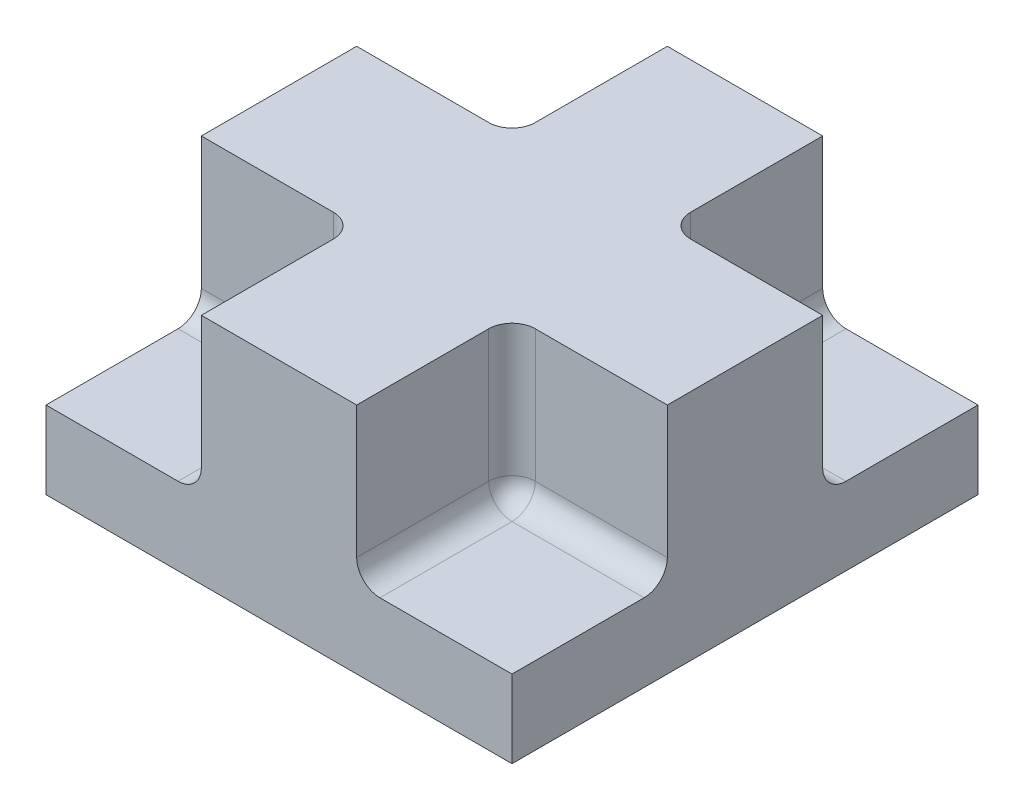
ISO-10303-21;
HEADER;
FILE_DESCRIPTION(('STEP AP214'),'2;1');
FILE_NAME('part.step','',(''),(''),'','','');
FILE_SCHEMA(('AUTOMOTIVE_DESIGN { 1 0 10303 214 1 1 1 1 }'));
ENDSEC;
DATA;
#1=APPLICATION_CONTEXT('core data for automotive mechanical design processes');
#2=APPLICATION_PROTOCOL_DEFINITION('international standard','automotive_design',2000,#1);
#3=PRODUCT_CONTEXT('',#1,'mechanical');
#4=PRODUCT('Part','Part','',(#3));
#5=PRODUCT_RELATED_PRODUCT_CATEGORY('part','',(#4));
#6=PRODUCT_DEFINITION_FORMATION('','',#4);
#7=PRODUCT_DEFINITION_CONTEXT('part definition',#1,'design');
#8=PRODUCT_DEFINITION('design','',#6,#7);
#9=PRODUCT_DEFINITION_SHAPE('','',#8);
#10=(LENGTH_UNIT() NAMED_UNIT(*) SI_UNIT(.MILLI.,.METRE.));
#11=(NAMED_UNIT(*) PLANE_ANGLE_UNIT() SI_UNIT($,.RADIAN.));
#12=(NAMED_UNIT(*) SI_UNIT($,.STERADIAN.) SOLID_ANGLE_UNIT());
#13=UNCERTAINTY_MEASURE_WITH_UNIT(LENGTH_MEASURE(1.E-05),#10,'distance_accuracy_value','');
#14=(GEOMETRIC_REPRESENTATION_CONTEXT(3) GLOBAL_UNCERTAINTY_ASSIGNED_CONTEXT((#13)) GLOBAL_UNIT_ASSIGNED_CONTEXT((#10,
#11,#12)) REPRESENTATION_CONTEXT('',''));
#15=CARTESIAN_POINT('',(0.,0.,0.));
#16=DIRECTION('',(0.,0.,1.));
#17=DIRECTION('',(1.,0.,0.));
#18=AXIS2_PLACEMENT_3D('',#15,#16,#17);
#19=CARTESIAN_POINT('',(0.,30.,0.));
#20=DIRECTION('',(1.,0.,0.));
#21=DIRECTION('',(0.,0.,-1.));
#22=AXIS2_PLACEMENT_3D('',#19,#20,#21);
#23=PLANE('',#22);
#24=DIRECTION('',(0.,0.,1.));
#25=VECTOR('',#24,1.);
#26=CARTESIAN_POINT('',(0.,30.,0.));
#27=LINE('',#26,#25);
#28=CARTESIAN_POINT('',(0.,30.,-40.));
#29=VERTEX_POINT('',#28);
#30=CARTESIAN_POINT('',(0.,30.,-20.));
#31=VERTEX_POINT('',#30);
#32=EDGE_CURVE('E230',#29,#31,#27,.T.);
#33=ORIENTED_EDGE('',*,*,#32,.F.);
#34=DIRECTION('',(0.,1.,0.));
#35=VECTOR('',#34,1.);
#36=CARTESIAN_POINT('',(0.,10.,-40.));
#37=LINE('',#36,#35);
#38=CARTESIAN_POINT('',(0.,13.,-40.));
#39=VERTEX_POINT('',#38);
#40=EDGE_CURVE('E396',#39,#29,#37,.T.);
#41=ORIENTED_EDGE('',*,*,#40,.F.);
#42=CARTESIAN_POINT('',(0.,13.,-43.));
#43=DIRECTION('',(1.,0.,0.));
#44=DIRECTION('',(0.,0.,-1.));
#45=AXIS2_PLACEMENT_3D('',#42,#43,#44);
#46=CIRCLE('',#45,3.);
#47=CARTESIAN_POINT('',(0.,10.,-43.));
#48=VERTEX_POINT('',#47);
#49=EDGE_CURVE('E308',#39,#48,#46,.T.);
#50=ORIENTED_EDGE('',*,*,#49,.T.);
#51=DIRECTION('',(0.,0.,1.));
#52=VECTOR('',#51,1.);
#53=CARTESIAN_POINT('',(0.,10.,-60.));
#54=LINE('',#53,#52);
#55=CARTESIAN_POINT('',(0.,10.,-60.));
#56=VERTEX_POINT('',#55);
#57=EDGE_CURVE('E391',#56,#48,#54,.T.);
#58=ORIENTED_EDGE('',*,*,#57,.F.);
#59=DIRECTION('',(0.,-1.,0.));
#60=VECTOR('',#59,1.);
#61=CARTESIAN_POINT('',(0.,30.,-60.));
#62=LINE('',#61,#60);
#63=CARTESIAN_POINT('',(0.,0.,-60.));
#64=VERTEX_POINT('',#63);
#65=EDGE_CURVE('E242',#56,#64,#62,.T.);
#66=ORIENTED_EDGE('',*,*,#65,.T.);
#67=DIRECTION('',(0.,0.,1.));
#68=VECTOR('',#67,1.);
#69=CARTESIAN_POINT('',(0.,0.,0.));
#70=LINE('',#69,#68);
#71=CARTESIAN_POINT('',(0.,0.,0.));
#72=VERTEX_POINT('',#71);
#73=EDGE_CURVE('E412',#64,#72,#70,.T.);
#74=ORIENTED_EDGE('',*,*,#73,.T.);
#75=DIRECTION('',(0.,-1.,0.));
#76=VECTOR('',#75,1.);
#77=CARTESIAN_POINT('',(0.,30.,0.));
#78=LINE('',#77,#76);
#79=CARTESIAN_POINT('',(0.,10.,0.));
#80=VERTEX_POINT('',#79);
#81=EDGE_CURVE('E248',#80,#72,#78,.T.);
#82=ORIENTED_EDGE('',*,*,#81,.F.);
#83=DIRECTION('',(0.,0.,1.));
#84=VECTOR('',#83,1.);
#85=CARTESIAN_POINT('',(0.,10.,0.));
#86=LINE('',#85,#84);
#87=CARTESIAN_POINT('',(0.,10.,-17.));
#88=VERTEX_POINT('',#87);
#89=EDGE_CURVE('E404',#88,#80,#86,.T.);
#90=ORIENTED_EDGE('',*,*,#89,.F.);
#91=CARTESIAN_POINT('',(0.,13.,-17.));
#92=DIRECTION('',(1.,0.,0.));
#93=DIRECTION('',(0.,0.,-1.));
#94=AXIS2_PLACEMENT_3D('',#91,#92,#93);
#95=CIRCLE('',#94,3.);
#96=CARTESIAN_POINT('',(0.,13.,-20.));
#97=VERTEX_POINT('',#96);
#98=EDGE_CURVE('E300',#88,#97,#95,.T.);
#99=ORIENTED_EDGE('',*,*,#98,.T.);
#100=DIRECTION('',(0.,1.,0.));
#101=VECTOR('',#100,1.);
#102=CARTESIAN_POINT('',(0.,10.,-20.));
#103=LINE('',#102,#101);
#104=EDGE_CURVE('E410',#97,#31,#103,.T.);
#105=ORIENTED_EDGE('',*,*,#104,.T.);
#106=EDGE_LOOP('',(#33,#41,#50,#58,#66,#74,#82,#90,#99,#105));
#107=FACE_BOUND('',#106,.T.);
#108=ADVANCED_FACE('F33',(#107),#23,.F.);
#109=CARTESIAN_POINT('',(0.,30.,0.));
#110=DIRECTION('',(0.,0.,-1.));
#111=DIRECTION('',(-1.,0.,0.));
#112=AXIS2_PLACEMENT_3D('',#109,#110,#111);
#113=PLANE('',#112);
#114=DIRECTION('',(1.,0.,0.));
#115=VECTOR('',#114,1.);
#116=CARTESIAN_POINT('',(60.,10.,0.));
#117=LINE('',#116,#115);
#118=CARTESIAN_POINT('',(43.,10.,0.));
#119=VERTEX_POINT('',#118);
#120=CARTESIAN_POINT('',(60.,10.,0.));
#121=VERTEX_POINT('',#120);
#122=EDGE_CURVE('E368',#119,#121,#117,.T.);
#123=ORIENTED_EDGE('',*,*,#122,.F.);
#124=CARTESIAN_POINT('',(43.,13.,0.));
#125=DIRECTION('',(0.,0.,-1.));
#126=DIRECTION('',(-1.,0.,0.));
#127=AXIS2_PLACEMENT_3D('',#124,#125,#126);
#128=CIRCLE('',#127,3.);
#129=CARTESIAN_POINT('',(40.,13.,0.));
#130=VERTEX_POINT('',#129);
#131=EDGE_CURVE('E40',#119,#130,#128,.T.);
#132=ORIENTED_EDGE('',*,*,#131,.T.);
#133=DIRECTION('',(0.,1.,0.));
#134=VECTOR('',#133,1.);
#135=CARTESIAN_POINT('',(40.,10.,0.));
#136=LINE('',#135,#134);
#137=CARTESIAN_POINT('',(40.,30.,0.));
#138=VERTEX_POINT('',#137);
#139=EDGE_CURVE('E203',#130,#138,#136,.T.);
#140=ORIENTED_EDGE('',*,*,#139,.T.);
#141=DIRECTION('',(1.,0.,0.));
#142=VECTOR('',#141,1.);
#143=CARTESIAN_POINT('',(0.,30.,0.));
#144=LINE('',#143,#142);
#145=CARTESIAN_POINT('',(20.,30.,0.));
#146=VERTEX_POINT('',#145);
#147=EDGE_CURVE('E208',#146,#138,#144,.T.);
#148=ORIENTED_EDGE('',*,*,#147,.F.);
#149=DIRECTION('',(0.,1.,0.));
#150=VECTOR('',#149,1.);
#151=CARTESIAN_POINT('',(20.,10.,0.));
#152=LINE('',#151,#150);
#153=CARTESIAN_POINT('',(20.,13.,0.));
#154=VERTEX_POINT('',#153);
#155=EDGE_CURVE('E409',#154,#146,#152,.T.);
#156=ORIENTED_EDGE('',*,*,#155,.F.);
#157=CARTESIAN_POINT('',(17.,13.,0.));
#158=DIRECTION('',(0.,0.,-1.));
#159=DIRECTION('',(-1.,0.,0.));
#160=AXIS2_PLACEMENT_3D('',#157,#158,#159);
#161=CIRCLE('',#160,3.);
#162=CARTESIAN_POINT('',(17.,10.,0.));
#163=VERTEX_POINT('',#162);
#164=EDGE_CURVE('E302',#154,#163,#161,.T.);
#165=ORIENTED_EDGE('',*,*,#164,.T.);
#166=DIRECTION('',(1.,0.,0.));
#167=VECTOR('',#166,1.);
#168=CARTESIAN_POINT('',(0.,10.,0.));
#169=LINE('',#168,#167);
#170=EDGE_CURVE('E406',#80,#163,#169,.T.);
#171=ORIENTED_EDGE('',*,*,#170,.F.);
#172=ORIENTED_EDGE('',*,*,#81,.T.);
#173=DIRECTION('',(1.,0.,0.));
#174=VECTOR('',#173,1.);
#175=CARTESIAN_POINT('',(0.,0.,0.));
#176=LINE('',#175,#174);
#177=CARTESIAN_POINT('',(60.,0.,0.));
#178=VERTEX_POINT('',#177);
#179=EDGE_CURVE('E416',#72,#178,#176,.T.);
#180=ORIENTED_EDGE('',*,*,#179,.T.);
#181=DIRECTION('',(0.,-1.,0.));
#182=VECTOR('',#181,1.);
#183=CARTESIAN_POINT('',(60.,30.,0.));
#184=LINE('',#183,#182);
#185=EDGE_CURVE('E246',#121,#178,#184,.T.);
#186=ORIENTED_EDGE('',*,*,#185,.F.);
#187=EDGE_LOOP('',(#123,#132,#140,#148,#156,#165,#171,#172,#180,#186));
#188=FACE_BOUND('',#187,.T.);
#189=ADVANCED_FACE('F205',(#188),#113,.F.);
#190=CARTESIAN_POINT('',(60.,30.,0.));
#191=DIRECTION('',(-1.,0.,0.));
#192=DIRECTION('',(0.,0.,1.));
#193=AXIS2_PLACEMENT_3D('',#190,#191,#192);
#194=PLANE('',#193);
#195=DIRECTION('',(0.,0.,-1.));
#196=VECTOR('',#195,1.);
#197=CARTESIAN_POINT('',(60.,30.,0.));
#198=LINE('',#197,#196);
#199=CARTESIAN_POINT('',(60.,30.,-20.));
#200=VERTEX_POINT('',#199);
#201=CARTESIAN_POINT('',(60.,30.,-40.));
#202=VERTEX_POINT('',#201);
#203=EDGE_CURVE('E229',#200,#202,#198,.T.);
#204=ORIENTED_EDGE('',*,*,#203,.F.);
#205=DIRECTION('',(0.,1.,0.));
#206=VECTOR('',#205,1.);
#207=CARTESIAN_POINT('',(60.,10.,-20.));
#208=LINE('',#207,#206);
#209=CARTESIAN_POINT('',(60.,13.,-20.));
#210=VERTEX_POINT('',#209);
#211=EDGE_CURVE('E213',#210,#200,#208,.T.);
#212=ORIENTED_EDGE('',*,*,#211,.F.);
#213=CARTESIAN_POINT('',(60.,13.,-17.));
#214=DIRECTION('',(-1.,0.,0.));
#215=DIRECTION('',(0.,0.,1.));
#216=AXIS2_PLACEMENT_3D('',#213,#214,#215);
#217=CIRCLE('',#216,3.);
#218=CARTESIAN_POINT('',(60.,10.,-17.));
#219=VERTEX_POINT('',#218);
#220=EDGE_CURVE('E11',#210,#219,#217,.T.);
#221=ORIENTED_EDGE('',*,*,#220,.T.);
#222=DIRECTION('',(0.,0.,-1.));
#223=VECTOR('',#222,1.);
#224=CARTESIAN_POINT('',(60.,10.,0.));
#225=LINE('',#224,#223);
#226=EDGE_CURVE('E222',#121,#219,#225,.T.);
#227=ORIENTED_EDGE('',*,*,#226,.F.);
#228=ORIENTED_EDGE('',*,*,#185,.T.);
#229=DIRECTION('',(0.,0.,-1.));
#230=VECTOR('',#229,1.);
#231=CARTESIAN_POINT('',(60.,0.,0.));
#232=LINE('',#231,#230);
#233=CARTESIAN_POINT('',(60.,0.,-60.));
#234=VERTEX_POINT('',#233);
#235=EDGE_CURVE('E419',#178,#234,#232,.T.);
#236=ORIENTED_EDGE('',*,*,#235,.T.);
#237=DIRECTION('',(0.,-1.,0.));
#238=VECTOR('',#237,1.);
#239=CARTESIAN_POINT('',(60.,30.,-60.));
#240=LINE('',#239,#238);
#241=CARTESIAN_POINT('',(60.,10.,-60.));
#242=VERTEX_POINT('',#241);
#243=EDGE_CURVE('E244',#242,#234,#240,.T.);
#244=ORIENTED_EDGE('',*,*,#243,.F.);
#245=DIRECTION('',(0.,0.,-1.));
#246=VECTOR('',#245,1.);
#247=CARTESIAN_POINT('',(60.,10.,-60.));
#248=LINE('',#247,#246);
#249=CARTESIAN_POINT('',(60.,10.,-43.));
#250=VERTEX_POINT('',#249);
#251=EDGE_CURVE('E376',#250,#242,#248,.T.);
#252=ORIENTED_EDGE('',*,*,#251,.F.);
#253=CARTESIAN_POINT('',(60.,13.,-43.));
#254=DIRECTION('',(-1.,0.,0.));
#255=DIRECTION('',(0.,0.,1.));
#256=AXIS2_PLACEMENT_3D('',#253,#254,#255);
#257=CIRCLE('',#256,3.);
#258=CARTESIAN_POINT('',(60.,13.,-40.));
#259=VERTEX_POINT('',#258);
#260=EDGE_CURVE('E312',#250,#259,#257,.T.);
#261=ORIENTED_EDGE('',*,*,#260,.T.);
#262=DIRECTION('',(0.,1.,0.));
#263=VECTOR('',#262,1.);
#264=CARTESIAN_POINT('',(60.,10.,-40.));
#265=LINE('',#264,#263);
#266=EDGE_CURVE('E382',#259,#202,#265,.T.);
#267=ORIENTED_EDGE('',*,*,#266,.T.);
#268=EDGE_LOOP('',(#204,#212,#221,#227,#228,#236,#244,#252,#261,#267));
#269=FACE_BOUND('',#268,.T.);
#270=ADVANCED_FACE('F484',(#269),#194,.F.);
#271=CARTESIAN_POINT('',(0.,30.,-60.));
#272=DIRECTION('',(0.,0.,1.));
#273=DIRECTION('',(1.,0.,0.));
#274=AXIS2_PLACEMENT_3D('',#271,#272,#273);
#275=PLANE('',#274);
#276=DIRECTION('',(-1.,0.,0.));
#277=VECTOR('',#276,1.);
#278=CARTESIAN_POINT('',(0.,30.,-60.));
#279=LINE('',#278,#277);
#280=CARTESIAN_POINT('',(40.,30.,-60.));
#281=VERTEX_POINT('',#280);
#282=CARTESIAN_POINT('',(20.,30.,-60.));
#283=VERTEX_POINT('',#282);
#284=EDGE_CURVE('E233',#281,#283,#279,.T.);
#285=ORIENTED_EDGE('',*,*,#284,.F.);
#286=DIRECTION('',(0.,1.,0.));
#287=VECTOR('',#286,1.);
#288=CARTESIAN_POINT('',(40.,10.,-60.));
#289=LINE('',#288,#287);
#290=CARTESIAN_POINT('',(40.,13.,-60.));
#291=VERTEX_POINT('',#290);
#292=EDGE_CURVE('E381',#291,#281,#289,.T.);
#293=ORIENTED_EDGE('',*,*,#292,.F.);
#294=CARTESIAN_POINT('',(43.,13.,-60.));
#295=DIRECTION('',(0.,0.,1.));
#296=DIRECTION('',(1.,0.,0.));
#297=AXIS2_PLACEMENT_3D('',#294,#295,#296);
#298=CIRCLE('',#297,3.);
#299=CARTESIAN_POINT('',(43.,10.,-60.));
#300=VERTEX_POINT('',#299);
#301=EDGE_CURVE('E314',#291,#300,#298,.T.);
#302=ORIENTED_EDGE('',*,*,#301,.T.);
#303=DIRECTION('',(-1.,0.,0.));
#304=VECTOR('',#303,1.);
#305=CARTESIAN_POINT('',(60.,10.,-60.));
#306=LINE('',#305,#304);
#307=EDGE_CURVE('E378',#242,#300,#306,.T.);
#308=ORIENTED_EDGE('',*,*,#307,.F.);
#309=ORIENTED_EDGE('',*,*,#243,.T.);
#310=DIRECTION('',(-1.,0.,0.));
#311=VECTOR('',#310,1.);
#312=CARTESIAN_POINT('',(0.,0.,-60.));
#313=LINE('',#312,#311);
#314=EDGE_CURVE('E236',#234,#64,#313,.T.);
#315=ORIENTED_EDGE('',*,*,#314,.T.);
#316=ORIENTED_EDGE('',*,*,#65,.F.);
#317=DIRECTION('',(-1.,0.,0.));
#318=VECTOR('',#317,1.);
#319=CARTESIAN_POINT('',(0.,10.,-60.));
#320=LINE('',#319,#318);
#321=CARTESIAN_POINT('',(17.,10.,-60.));
#322=VERTEX_POINT('',#321);
#323=EDGE_CURVE('E394',#322,#56,#320,.T.);
#324=ORIENTED_EDGE('',*,*,#323,.F.);
#325=CARTESIAN_POINT('',(17.,13.,-60.));
#326=DIRECTION('',(0.,0.,1.));
#327=DIRECTION('',(1.,0.,0.));
#328=AXIS2_PLACEMENT_3D('',#325,#326,#327);
#329=CIRCLE('',#328,3.);
#330=CARTESIAN_POINT('',(20.,13.,-60.));
#331=VERTEX_POINT('',#330);
#332=EDGE_CURVE('E306',#322,#331,#329,.T.);
#333=ORIENTED_EDGE('',*,*,#332,.T.);
#334=DIRECTION('',(0.,1.,0.));
#335=VECTOR('',#334,1.);
#336=CARTESIAN_POINT('',(20.,10.,-60.));
#337=LINE('',#336,#335);
#338=EDGE_CURVE('E397',#331,#283,#337,.T.);
#339=ORIENTED_EDGE('',*,*,#338,.T.);
#340=EDGE_LOOP('',(#285,#293,#302,#308,#309,#315,#316,#324,#333,#339));
#341=FACE_BOUND('',#340,.T.);
#342=ADVANCED_FACE('F427',(#341),#275,.F.);
#343=CARTESIAN_POINT('',(0.,30.,-60.));
#344=DIRECTION('',(0.,-1.,0.));
#345=DIRECTION('',(0.,0.,-1.));
#346=AXIS2_PLACEMENT_3D('',#343,#344,#345);
#347=PLANE('',#346);
#348=ORIENTED_EDGE('',*,*,#147,.T.);
#349=DIRECTION('',(0.,0.,1.));
#350=VECTOR('',#349,1.);
#351=CARTESIAN_POINT('',(40.,30.,0.));
#352=LINE('',#351,#350);
#353=CARTESIAN_POINT('',(40.,30.,-17.));
#354=VERTEX_POINT('',#353);
#355=EDGE_CURVE('E217',#354,#138,#352,.T.);
#356=ORIENTED_EDGE('',*,*,#355,.F.);
#357=CARTESIAN_POINT('',(43.,30.,-17.));
#358=DIRECTION('',(0.,-1.,0.));
#359=DIRECTION('',(0.,0.,-1.));
#360=AXIS2_PLACEMENT_3D('',#357,#358,#359);
#361=CIRCLE('',#360,3.);
#362=CARTESIAN_POINT('',(43.,30.,-20.));
#363=VERTEX_POINT('',#362);
#364=EDGE_CURVE('E316',#354,#363,#361,.T.);
#365=ORIENTED_EDGE('',*,*,#364,.T.);
#366=DIRECTION('',(-1.,0.,0.));
#367=VECTOR('',#366,1.);
#368=CARTESIAN_POINT('',(60.,30.,-20.));
#369=LINE('',#368,#367);
#370=EDGE_CURVE('E223',#200,#363,#369,.T.);
#371=ORIENTED_EDGE('',*,*,#370,.F.);
#372=ORIENTED_EDGE('',*,*,#203,.T.);
#373=DIRECTION('',(1.,0.,0.));
#374=VECTOR('',#373,1.);
#375=CARTESIAN_POINT('',(60.,30.,-40.));
#376=LINE('',#375,#374);
#377=CARTESIAN_POINT('',(43.,30.,-40.));
#378=VERTEX_POINT('',#377);
#379=EDGE_CURVE('E373',#378,#202,#376,.T.);
#380=ORIENTED_EDGE('',*,*,#379,.F.);
#381=CARTESIAN_POINT('',(43.,30.,-43.));
#382=DIRECTION('',(0.,-1.,0.));
#383=DIRECTION('',(0.,0.,-1.));
#384=AXIS2_PLACEMENT_3D('',#381,#382,#383);
#385=CIRCLE('',#384,3.);
#386=CARTESIAN_POINT('',(40.,30.,-43.));
#387=VERTEX_POINT('',#386);
#388=EDGE_CURVE('E310',#378,#387,#385,.T.);
#389=ORIENTED_EDGE('',*,*,#388,.T.);
#390=DIRECTION('',(0.,0.,1.));
#391=VECTOR('',#390,1.);
#392=CARTESIAN_POINT('',(40.,30.,-60.));
#393=LINE('',#392,#391);
#394=EDGE_CURVE('E212',#281,#387,#393,.T.);
#395=ORIENTED_EDGE('',*,*,#394,.F.);
#396=ORIENTED_EDGE('',*,*,#284,.T.);
#397=DIRECTION('',(0.,0.,-1.));
#398=VECTOR('',#397,1.);
#399=CARTESIAN_POINT('',(20.,30.,-60.));
#400=LINE('',#399,#398);
#401=CARTESIAN_POINT('',(20.,30.,-43.));
#402=VERTEX_POINT('',#401);
#403=EDGE_CURVE('E388',#402,#283,#400,.T.);
#404=ORIENTED_EDGE('',*,*,#403,.F.);
#405=CARTESIAN_POINT('',(17.,30.,-43.));
#406=DIRECTION('',(0.,-1.,0.));
#407=DIRECTION('',(0.,0.,-1.));
#408=AXIS2_PLACEMENT_3D('',#405,#406,#407);
#409=CIRCLE('',#408,3.);
#410=CARTESIAN_POINT('',(17.,30.,-40.));
#411=VERTEX_POINT('',#410);
#412=EDGE_CURVE('E304',#402,#411,#409,.T.);
#413=ORIENTED_EDGE('',*,*,#412,.T.);
#414=DIRECTION('',(1.,0.,0.));
#415=VECTOR('',#414,1.);
#416=CARTESIAN_POINT('',(0.,30.,-40.));
#417=LINE('',#416,#415);
#418=EDGE_CURVE('E384',#29,#411,#417,.T.);
#419=ORIENTED_EDGE('',*,*,#418,.F.);
#420=ORIENTED_EDGE('',*,*,#32,.T.);
#421=DIRECTION('',(-1.,0.,0.));
#422=VECTOR('',#421,1.);
#423=CARTESIAN_POINT('',(0.,30.,-20.));
#424=LINE('',#423,#422);
#425=CARTESIAN_POINT('',(17.,30.,-20.));
#426=VERTEX_POINT('',#425);
#427=EDGE_CURVE('E401',#426,#31,#424,.T.);
#428=ORIENTED_EDGE('',*,*,#427,.F.);
#429=CARTESIAN_POINT('',(17.,30.,-17.));
#430=DIRECTION('',(0.,-1.,0.));
#431=DIRECTION('',(0.,0.,-1.));
#432=AXIS2_PLACEMENT_3D('',#429,#430,#431);
#433=CIRCLE('',#432,3.);
#434=CARTESIAN_POINT('',(20.,30.,-17.));
#435=VERTEX_POINT('',#434);
#436=EDGE_CURVE('E298',#426,#435,#433,.T.);
#437=ORIENTED_EDGE('',*,*,#436,.T.);
#438=DIRECTION('',(0.,0.,-1.));
#439=VECTOR('',#438,1.);
#440=CARTESIAN_POINT('',(20.,30.,0.));
#441=LINE('',#440,#439);
#442=EDGE_CURVE('E228',#146,#435,#441,.T.);
#443=ORIENTED_EDGE('',*,*,#442,.F.);
#444=EDGE_LOOP('',(#348,#356,#365,#371,#372,#380,#389,#395,#396,#404,#413,#419,#420,#428,#437,#443));
#445=FACE_BOUND('',#444,.T.);
#446=ADVANCED_FACE('F226',(#445),#347,.F.);
#447=CARTESIAN_POINT('',(0.,0.,-60.));
#448=DIRECTION('',(0.,-1.,0.));
#449=DIRECTION('',(0.,0.,-1.));
#450=AXIS2_PLACEMENT_3D('',#447,#448,#449);
#451=PLANE('',#450);
#452=ORIENTED_EDGE('',*,*,#73,.F.);
#453=ORIENTED_EDGE('',*,*,#314,.F.);
#454=ORIENTED_EDGE('',*,*,#235,.F.);
#455=ORIENTED_EDGE('',*,*,#179,.F.);
#456=EDGE_LOOP('',(#452,#453,#454,#455));
#457=FACE_BOUND('',#456,.T.);
#458=ADVANCED_FACE('F434',(#457),#451,.T.);
#459=CARTESIAN_POINT('',(0.,10.,-20.));
#460=DIRECTION('',(0.,0.,-1.));
#461=DIRECTION('',(-1.,0.,0.));
#462=AXIS2_PLACEMENT_3D('',#459,#460,#461);
#463=PLANE('',#462);
#464=DIRECTION('',(-1.,0.,0.));
#465=VECTOR('',#464,1.);
#466=CARTESIAN_POINT('',(20.,13.,-20.));
#467=LINE('',#466,#465);
#468=CARTESIAN_POINT('',(17.,13.,-20.));
#469=VERTEX_POINT('',#468);
#470=EDGE_CURVE('E250',#97,#469,#467,.F.);
#471=ORIENTED_EDGE('',*,*,#470,.T.);
#472=DIRECTION('',(0.,1.,0.));
#473=VECTOR('',#472,1.);
#474=CARTESIAN_POINT('',(17.,30.,-20.));
#475=LINE('',#474,#473);
#476=EDGE_CURVE('E252',#469,#426,#475,.T.);
#477=ORIENTED_EDGE('',*,*,#476,.T.);
#478=ORIENTED_EDGE('',*,*,#427,.T.);
#479=ORIENTED_EDGE('',*,*,#104,.F.);
#480=EDGE_LOOP('',(#471,#477,#478,#479));
#481=FACE_BOUND('',#480,.T.);
#482=ADVANCED_FACE('F522',(#481),#463,.F.);
#483=CARTESIAN_POINT('',(20.,10.,0.));
#484=DIRECTION('',(1.,0.,0.));
#485=DIRECTION('',(0.,0.,-1.));
#486=AXIS2_PLACEMENT_3D('',#483,#484,#485);
#487=PLANE('',#486);
#488=ORIENTED_EDGE('',*,*,#442,.T.);
#489=DIRECTION('',(0.,1.,0.));
#490=VECTOR('',#489,1.);
#491=CARTESIAN_POINT('',(20.,10.,-17.));
#492=LINE('',#491,#490);
#493=CARTESIAN_POINT('',(20.,13.,-17.));
#494=VERTEX_POINT('',#493);
#495=EDGE_CURVE('E257',#435,#494,#492,.F.);
#496=ORIENTED_EDGE('',*,*,#495,.T.);
#497=DIRECTION('',(0.,0.,-1.));
#498=VECTOR('',#497,1.);
#499=CARTESIAN_POINT('',(20.,13.,0.));
#500=LINE('',#499,#498);
#501=EDGE_CURVE('E255',#494,#154,#500,.F.);
#502=ORIENTED_EDGE('',*,*,#501,.T.);
#503=ORIENTED_EDGE('',*,*,#155,.T.);
#504=EDGE_LOOP('',(#488,#496,#502,#503));
#505=FACE_BOUND('',#504,.T.);
#506=ADVANCED_FACE('F523',(#505),#487,.F.);
#507=CARTESIAN_POINT('',(0.,10.,-20.));
#508=DIRECTION('',(0.,-1.,0.));
#509=DIRECTION('',(0.,0.,-1.));
#510=AXIS2_PLACEMENT_3D('',#507,#508,#509);
#511=PLANE('',#510);
#512=DIRECTION('',(0.,0.,-1.));
#513=VECTOR('',#512,1.);
#514=CARTESIAN_POINT('',(17.,10.,-20.));
#515=LINE('',#514,#513);
#516=CARTESIAN_POINT('',(17.,10.,-17.));
#517=VERTEX_POINT('',#516);
#518=EDGE_CURVE('E259',#163,#517,#515,.T.);
#519=ORIENTED_EDGE('',*,*,#518,.T.);
#520=DIRECTION('',(-1.,0.,0.));
#521=VECTOR('',#520,1.);
#522=CARTESIAN_POINT('',(0.,10.,-17.));
#523=LINE('',#522,#521);
#524=EDGE_CURVE('E261',#517,#88,#523,.T.);
#525=ORIENTED_EDGE('',*,*,#524,.T.);
#526=ORIENTED_EDGE('',*,*,#89,.T.);
#527=ORIENTED_EDGE('',*,*,#170,.T.);
#528=EDGE_LOOP('',(#519,#525,#526,#527));
#529=FACE_BOUND('',#528,.T.);
#530=ADVANCED_FACE('F526',(#529),#511,.F.);
#531=CARTESIAN_POINT('',(20.,10.,-60.));
#532=DIRECTION('',(1.,0.,0.));
#533=DIRECTION('',(0.,0.,-1.));
#534=AXIS2_PLACEMENT_3D('',#531,#532,#533);
#535=PLANE('',#534);
#536=DIRECTION('',(0.,0.,-1.));
#537=VECTOR('',#536,1.);
#538=CARTESIAN_POINT('',(20.,13.,-60.));
#539=LINE('',#538,#537);
#540=CARTESIAN_POINT('',(20.,13.,-43.));
#541=VERTEX_POINT('',#540);
#542=EDGE_CURVE('E263',#331,#541,#539,.F.);
#543=ORIENTED_EDGE('',*,*,#542,.T.);
#544=DIRECTION('',(0.,1.,0.));
#545=VECTOR('',#544,1.);
#546=CARTESIAN_POINT('',(20.,30.,-43.));
#547=LINE('',#546,#545);
#548=EDGE_CURVE('E265',#541,#402,#547,.T.);
#549=ORIENTED_EDGE('',*,*,#548,.T.);
#550=ORIENTED_EDGE('',*,*,#403,.T.);
#551=ORIENTED_EDGE('',*,*,#338,.F.);
#552=EDGE_LOOP('',(#543,#549,#550,#551));
#553=FACE_BOUND('',#552,.T.);
#554=ADVANCED_FACE('F461',(#553),#535,.F.);
#555=CARTESIAN_POINT('',(0.,10.,-40.));
#556=DIRECTION('',(0.,0.,1.));
#557=DIRECTION('',(1.,0.,0.));
#558=AXIS2_PLACEMENT_3D('',#555,#556,#557);
#559=PLANE('',#558);
#560=ORIENTED_EDGE('',*,*,#418,.T.);
#561=DIRECTION('',(0.,1.,0.));
#562=VECTOR('',#561,1.);
#563=CARTESIAN_POINT('',(17.,10.,-40.));
#564=LINE('',#563,#562);
#565=CARTESIAN_POINT('',(17.,13.,-40.));
#566=VERTEX_POINT('',#565);
#567=EDGE_CURVE('E270',#411,#566,#564,.F.);
#568=ORIENTED_EDGE('',*,*,#567,.T.);
#569=DIRECTION('',(1.,0.,0.));
#570=VECTOR('',#569,1.);
#571=CARTESIAN_POINT('',(0.,13.,-40.));
#572=LINE('',#571,#570);
#573=EDGE_CURVE('E268',#566,#39,#572,.F.);
#574=ORIENTED_EDGE('',*,*,#573,.T.);
#575=ORIENTED_EDGE('',*,*,#40,.T.);
#576=EDGE_LOOP('',(#560,#568,#574,#575));
#577=FACE_BOUND('',#576,.T.);
#578=ADVANCED_FACE('F534',(#577),#559,.F.);
#579=CARTESIAN_POINT('',(0.,10.,-40.));
#580=DIRECTION('',(0.,1.,0.));
#581=DIRECTION('',(0.,0.,1.));
#582=AXIS2_PLACEMENT_3D('',#579,#580,#581);
#583=PLANE('',#582);
#584=DIRECTION('',(1.,0.,0.));
#585=VECTOR('',#584,1.);
#586=CARTESIAN_POINT('',(0.,10.,-43.));
#587=LINE('',#586,#585);
#588=CARTESIAN_POINT('',(17.,10.,-43.));
#589=VERTEX_POINT('',#588);
#590=EDGE_CURVE('E272',#48,#589,#587,.T.);
#591=ORIENTED_EDGE('',*,*,#590,.T.);
#592=DIRECTION('',(0.,0.,-1.));
#593=VECTOR('',#592,1.);
#594=CARTESIAN_POINT('',(17.,10.,-40.));
#595=LINE('',#594,#593);
#596=EDGE_CURVE('E274',#589,#322,#595,.T.);
#597=ORIENTED_EDGE('',*,*,#596,.T.);
#598=ORIENTED_EDGE('',*,*,#323,.T.);
#599=ORIENTED_EDGE('',*,*,#57,.T.);
#600=EDGE_LOOP('',(#591,#597,#598,#599));
#601=FACE_BOUND('',#600,.T.);
#602=ADVANCED_FACE('F444',(#601),#583,.T.);
#603=CARTESIAN_POINT('',(60.,10.,-40.));
#604=DIRECTION('',(0.,0.,1.));
#605=DIRECTION('',(1.,0.,0.));
#606=AXIS2_PLACEMENT_3D('',#603,#604,#605);
#607=PLANE('',#606);
#608=DIRECTION('',(1.,0.,0.));
#609=VECTOR('',#608,1.);
#610=CARTESIAN_POINT('',(40.,13.,-40.));
#611=LINE('',#610,#609);
#612=CARTESIAN_POINT('',(43.,13.,-40.));
#613=VERTEX_POINT('',#612);
#614=EDGE_CURVE('E276',#259,#613,#611,.F.);
#615=ORIENTED_EDGE('',*,*,#614,.T.);
#616=DIRECTION('',(0.,1.,0.));
#617=VECTOR('',#616,1.);
#618=CARTESIAN_POINT('',(43.,30.,-40.));
#619=LINE('',#618,#617);
#620=EDGE_CURVE('E278',#613,#378,#619,.T.);
#621=ORIENTED_EDGE('',*,*,#620,.T.);
#622=ORIENTED_EDGE('',*,*,#379,.T.);
#623=ORIENTED_EDGE('',*,*,#266,.F.);
#624=EDGE_LOOP('',(#615,#621,#622,#623));
#625=FACE_BOUND('',#624,.T.);
#626=ADVANCED_FACE('F486',(#625),#607,.F.);
#627=CARTESIAN_POINT('',(40.,10.,-60.));
#628=DIRECTION('',(-1.,0.,0.));
#629=DIRECTION('',(0.,0.,1.));
#630=AXIS2_PLACEMENT_3D('',#627,#628,#629);
#631=PLANE('',#630);
#632=ORIENTED_EDGE('',*,*,#394,.T.);
#633=DIRECTION('',(0.,1.,0.));
#634=VECTOR('',#633,1.);
#635=CARTESIAN_POINT('',(40.,10.,-43.));
#636=LINE('',#635,#634);
#637=CARTESIAN_POINT('',(40.,13.,-43.));
#638=VERTEX_POINT('',#637);
#639=EDGE_CURVE('E283',#387,#638,#636,.F.);
#640=ORIENTED_EDGE('',*,*,#639,.T.);
#641=DIRECTION('',(0.,0.,1.));
#642=VECTOR('',#641,1.);
#643=CARTESIAN_POINT('',(40.,13.,-60.));
#644=LINE('',#643,#642);
#645=EDGE_CURVE('E281',#638,#291,#644,.F.);
#646=ORIENTED_EDGE('',*,*,#645,.T.);
#647=ORIENTED_EDGE('',*,*,#292,.T.);
#648=EDGE_LOOP('',(#632,#640,#646,#647));
#649=FACE_BOUND('',#648,.T.);
#650=ADVANCED_FACE('F542',(#649),#631,.F.);
#651=CARTESIAN_POINT('',(60.,10.,-60.));
#652=DIRECTION('',(0.,-1.,0.));
#653=DIRECTION('',(0.,0.,-1.));
#654=AXIS2_PLACEMENT_3D('',#651,#652,#653);
#655=PLANE('',#654);
#656=DIRECTION('',(0.,0.,1.));
#657=VECTOR('',#656,1.);
#658=CARTESIAN_POINT('',(43.,10.,-40.));
#659=LINE('',#658,#657);
#660=CARTESIAN_POINT('',(43.,10.,-43.));
#661=VERTEX_POINT('',#660);
#662=EDGE_CURVE('E285',#300,#661,#659,.T.);
#663=ORIENTED_EDGE('',*,*,#662,.T.);
#664=DIRECTION('',(1.,0.,0.));
#665=VECTOR('',#664,1.);
#666=CARTESIAN_POINT('',(60.,10.,-43.));
#667=LINE('',#666,#665);
#668=EDGE_CURVE('E287',#661,#250,#667,.T.);
#669=ORIENTED_EDGE('',*,*,#668,.T.);
#670=ORIENTED_EDGE('',*,*,#251,.T.);
#671=ORIENTED_EDGE('',*,*,#307,.T.);
#672=EDGE_LOOP('',(#663,#669,#670,#671));
#673=FACE_BOUND('',#672,.T.);
#674=ADVANCED_FACE('F474',(#673),#655,.F.);
#675=CARTESIAN_POINT('',(40.,10.,0.));
#676=DIRECTION('',(-1.,0.,0.));
#677=DIRECTION('',(0.,0.,1.));
#678=AXIS2_PLACEMENT_3D('',#675,#676,#677);
#679=PLANE('',#678);
#680=DIRECTION('',(0.,0.,1.));
#681=VECTOR('',#680,1.);
#682=CARTESIAN_POINT('',(40.,13.,0.));
#683=LINE('',#682,#681);
#684=CARTESIAN_POINT('',(40.,13.,-17.));
#685=VERTEX_POINT('',#684);
#686=EDGE_CURVE('E289',#130,#685,#683,.F.);
#687=ORIENTED_EDGE('',*,*,#686,.T.);
#688=DIRECTION('',(0.,1.,0.));
#689=VECTOR('',#688,1.);
#690=CARTESIAN_POINT('',(40.,30.,-17.));
#691=LINE('',#690,#689);
#692=EDGE_CURVE('E220',#685,#354,#691,.T.);
#693=ORIENTED_EDGE('',*,*,#692,.T.);
#694=ORIENTED_EDGE('',*,*,#355,.T.);
#695=ORIENTED_EDGE('',*,*,#139,.F.);
#696=EDGE_LOOP('',(#687,#693,#694,#695));
#697=FACE_BOUND('',#696,.T.);
#698=ADVANCED_FACE('F218',(#697),#679,.F.);
#699=CARTESIAN_POINT('',(60.,10.,-20.));
#700=DIRECTION('',(0.,0.,-1.));
#701=DIRECTION('',(-1.,0.,0.));
#702=AXIS2_PLACEMENT_3D('',#699,#700,#701);
#703=PLANE('',#702);
#704=ORIENTED_EDGE('',*,*,#370,.T.);
#705=DIRECTION('',(0.,1.,0.));
#706=VECTOR('',#705,1.);
#707=CARTESIAN_POINT('',(43.,10.,-20.));
#708=LINE('',#707,#706);
#709=CARTESIAN_POINT('',(43.,13.,-20.));
#710=VERTEX_POINT('',#709);
#711=EDGE_CURVE('E294',#363,#710,#708,.F.);
#712=ORIENTED_EDGE('',*,*,#711,.T.);
#713=DIRECTION('',(-1.,0.,0.));
#714=VECTOR('',#713,1.);
#715=CARTESIAN_POINT('',(60.,13.,-20.));
#716=LINE('',#715,#714);
#717=EDGE_CURVE('E292',#710,#210,#716,.F.);
#718=ORIENTED_EDGE('',*,*,#717,.T.);
#719=ORIENTED_EDGE('',*,*,#211,.T.);
#720=EDGE_LOOP('',(#704,#712,#718,#719));
#721=FACE_BOUND('',#720,.T.);
#722=ADVANCED_FACE('F323',(#721),#703,.F.);
#723=CARTESIAN_POINT('',(60.,10.,-20.));
#724=DIRECTION('',(0.,1.,0.));
#725=DIRECTION('',(0.,0.,1.));
#726=AXIS2_PLACEMENT_3D('',#723,#724,#725);
#727=PLANE('',#726);
#728=DIRECTION('',(-1.,0.,0.));
#729=VECTOR('',#728,1.);
#730=CARTESIAN_POINT('',(60.,10.,-17.));
#731=LINE('',#730,#729);
#732=CARTESIAN_POINT('',(43.,10.,-17.));
#733=VERTEX_POINT('',#732);
#734=EDGE_CURVE('E47',#219,#733,#731,.T.);
#735=ORIENTED_EDGE('',*,*,#734,.T.);
#736=DIRECTION('',(0.,0.,1.));
#737=VECTOR('',#736,1.);
#738=CARTESIAN_POINT('',(43.,10.,-20.));
#739=LINE('',#738,#737);
#740=EDGE_CURVE('E51',#733,#119,#739,.T.);
#741=ORIENTED_EDGE('',*,*,#740,.T.);
#742=ORIENTED_EDGE('',*,*,#122,.T.);
#743=ORIENTED_EDGE('',*,*,#226,.T.);
#744=EDGE_LOOP('',(#735,#741,#742,#743));
#745=FACE_BOUND('',#744,.T.);
#746=ADVANCED_FACE('F551',(#745),#727,.T.);
#747=CARTESIAN_POINT('',(17.,13.,-20.));
#748=DIRECTION('',(0.,0.,1.));
#749=DIRECTION('',(1.,0.,0.));
#750=AXIS2_PLACEMENT_3D('',#747,#748,#749);
#751=CYLINDRICAL_SURFACE('',#750,3.);
#752=ORIENTED_EDGE('',*,*,#164,.F.);
#753=ORIENTED_EDGE('',*,*,#501,.F.);
#754=CARTESIAN_POINT('',(17.,13.,-17.));
#755=DIRECTION('',(0.,0.,1.));
#756=DIRECTION('',(1.,0.,0.));
#757=AXIS2_PLACEMENT_3D('',#754,#755,#756);
#758=CIRCLE('',#757,3.);
#759=EDGE_CURVE('E326',#517,#494,#758,.T.);
#760=ORIENTED_EDGE('',*,*,#759,.F.);
#761=ORIENTED_EDGE('',*,*,#518,.F.);
#762=EDGE_LOOP('',(#752,#753,#760,#761));
#763=FACE_BOUND('',#762,.T.);
#764=ADVANCED_FACE('F556',(#763),#751,.F.);
#765=CARTESIAN_POINT('',(0.,13.,-17.));
#766=DIRECTION('',(1.,0.,0.));
#767=DIRECTION('',(0.,0.,-1.));
#768=AXIS2_PLACEMENT_3D('',#765,#766,#767);
#769=CYLINDRICAL_SURFACE('',#768,3.);
#770=ORIENTED_EDGE('',*,*,#98,.F.);
#771=ORIENTED_EDGE('',*,*,#524,.F.);
#772=CARTESIAN_POINT('',(17.,13.,-17.));
#773=DIRECTION('',(-1.,0.,0.));
#774=DIRECTION('',(0.,0.,1.));
#775=AXIS2_PLACEMENT_3D('',#772,#773,#774);
#776=CIRCLE('',#775,3.);
#777=EDGE_CURVE('E362',#469,#517,#776,.T.);
#778=ORIENTED_EDGE('',*,*,#777,.F.);
#779=ORIENTED_EDGE('',*,*,#470,.F.);
#780=EDGE_LOOP('',(#770,#771,#778,#779));
#781=FACE_BOUND('',#780,.T.);
#782=ADVANCED_FACE('F559',(#781),#769,.F.);
#783=CARTESIAN_POINT('',(17.,13.,-17.));
#784=DIRECTION('',(0.,0.,1.));
#785=DIRECTION('',(1.,0.,0.));
#786=AXIS2_PLACEMENT_3D('',#783,#784,#785);
#787=SPHERICAL_SURFACE('',#786,3.);
#788=ORIENTED_EDGE('',*,*,#777,.T.);
#789=ORIENTED_EDGE('',*,*,#759,.T.);
#790=CARTESIAN_POINT('',(17.,13.,-17.));
#791=DIRECTION('',(0.,1.,0.));
#792=DIRECTION('',(0.,0.,1.));
#793=AXIS2_PLACEMENT_3D('',#790,#791,#792);
#794=CIRCLE('',#793,3.);
#795=EDGE_CURVE('E359',#469,#494,#794,.F.);
#796=ORIENTED_EDGE('',*,*,#795,.F.);
#797=EDGE_LOOP('',(#788,#789,#796));
#798=FACE_BOUND('',#797,.T.);
#799=ADVANCED_FACE('F563',(#798),#787,.F.);
#800=CARTESIAN_POINT('',(17.,10.,-17.));
#801=DIRECTION('',(0.,-1.,0.));
#802=DIRECTION('',(0.,0.,-1.));
#803=AXIS2_PLACEMENT_3D('',#800,#801,#802);
#804=CYLINDRICAL_SURFACE('',#803,3.);
#805=ORIENTED_EDGE('',*,*,#795,.T.);
#806=ORIENTED_EDGE('',*,*,#495,.F.);
#807=ORIENTED_EDGE('',*,*,#436,.F.);
#808=ORIENTED_EDGE('',*,*,#476,.F.);
#809=EDGE_LOOP('',(#805,#806,#807,#808));
#810=FACE_BOUND('',#809,.T.);
#811=ADVANCED_FACE('F567',(#810),#804,.F.);
#812=CARTESIAN_POINT('',(0.,13.,-43.));
#813=DIRECTION('',(1.,0.,0.));
#814=DIRECTION('',(0.,0.,-1.));
#815=AXIS2_PLACEMENT_3D('',#812,#813,#814);
#816=CYLINDRICAL_SURFACE('',#815,3.);
#817=ORIENTED_EDGE('',*,*,#49,.F.);
#818=ORIENTED_EDGE('',*,*,#573,.F.);
#819=CARTESIAN_POINT('',(17.,13.,-43.));
#820=DIRECTION('',(-1.,0.,0.));
#821=DIRECTION('',(0.,0.,1.));
#822=AXIS2_PLACEMENT_3D('',#819,#820,#821);
#823=CIRCLE('',#822,3.);
#824=EDGE_CURVE('E356',#589,#566,#823,.T.);
#825=ORIENTED_EDGE('',*,*,#824,.F.);
#826=ORIENTED_EDGE('',*,*,#590,.F.);
#827=EDGE_LOOP('',(#817,#818,#825,#826));
#828=FACE_BOUND('',#827,.T.);
#829=ADVANCED_FACE('F448',(#828),#816,.F.);
#830=CARTESIAN_POINT('',(17.,13.,-40.));
#831=DIRECTION('',(0.,0.,-1.));
#832=DIRECTION('',(-1.,0.,0.));
#833=AXIS2_PLACEMENT_3D('',#830,#831,#832);
#834=CYLINDRICAL_SURFACE('',#833,3.);
#835=ORIENTED_EDGE('',*,*,#332,.F.);
#836=ORIENTED_EDGE('',*,*,#596,.F.);
#837=CARTESIAN_POINT('',(17.,13.,-43.));
#838=DIRECTION('',(0.,0.,-1.));
#839=DIRECTION('',(-1.,0.,0.));
#840=AXIS2_PLACEMENT_3D('',#837,#838,#839);
#841=CIRCLE('',#840,3.);
#842=EDGE_CURVE('E353',#541,#589,#841,.T.);
#843=ORIENTED_EDGE('',*,*,#842,.F.);
#844=ORIENTED_EDGE('',*,*,#542,.F.);
#845=EDGE_LOOP('',(#835,#836,#843,#844));
#846=FACE_BOUND('',#845,.T.);
#847=ADVANCED_FACE('F458',(#846),#834,.F.);
#848=CARTESIAN_POINT('',(17.,13.,-43.));
#849=DIRECTION('',(0.,0.,1.));
#850=DIRECTION('',(1.,0.,0.));
#851=AXIS2_PLACEMENT_3D('',#848,#849,#850);
#852=SPHERICAL_SURFACE('',#851,3.);
#853=ORIENTED_EDGE('',*,*,#842,.T.);
#854=ORIENTED_EDGE('',*,*,#824,.T.);
#855=CARTESIAN_POINT('',(17.,13.,-43.));
#856=DIRECTION('',(0.,1.,0.));
#857=DIRECTION('',(0.,0.,1.));
#858=AXIS2_PLACEMENT_3D('',#855,#856,#857);
#859=CIRCLE('',#858,3.);
#860=EDGE_CURVE('E350',#541,#566,#859,.F.);
#861=ORIENTED_EDGE('',*,*,#860,.F.);
#862=EDGE_LOOP('',(#853,#854,#861));
#863=FACE_BOUND('',#862,.T.);
#864=ADVANCED_FACE('F453',(#863),#852,.F.);
#865=CARTESIAN_POINT('',(17.,10.,-43.));
#866=DIRECTION('',(0.,-1.,0.));
#867=DIRECTION('',(0.,0.,-1.));
#868=AXIS2_PLACEMENT_3D('',#865,#866,#867);
#869=CYLINDRICAL_SURFACE('',#868,3.);
#870=ORIENTED_EDGE('',*,*,#860,.T.);
#871=ORIENTED_EDGE('',*,*,#567,.F.);
#872=ORIENTED_EDGE('',*,*,#412,.F.);
#873=ORIENTED_EDGE('',*,*,#548,.F.);
#874=EDGE_LOOP('',(#870,#871,#872,#873));
#875=FACE_BOUND('',#874,.T.);
#876=ADVANCED_FACE('F578',(#875),#869,.F.);
#877=CARTESIAN_POINT('',(43.,13.,-60.));
#878=DIRECTION('',(0.,0.,-1.));
#879=DIRECTION('',(-1.,0.,0.));
#880=AXIS2_PLACEMENT_3D('',#877,#878,#879);
#881=CYLINDRICAL_SURFACE('',#880,3.);
#882=ORIENTED_EDGE('',*,*,#301,.F.);
#883=ORIENTED_EDGE('',*,*,#645,.F.);
#884=CARTESIAN_POINT('',(43.,13.,-43.));
#885=DIRECTION('',(0.,0.,-1.));
#886=DIRECTION('',(-1.,0.,0.));
#887=AXIS2_PLACEMENT_3D('',#884,#885,#886);
#888=CIRCLE('',#887,3.);
#889=EDGE_CURVE('E347',#661,#638,#888,.T.);
#890=ORIENTED_EDGE('',*,*,#889,.F.);
#891=ORIENTED_EDGE('',*,*,#662,.F.);
#892=EDGE_LOOP('',(#882,#883,#890,#891));
#893=FACE_BOUND('',#892,.T.);
#894=ADVANCED_FACE('F470',(#893),#881,.F.);
#895=CARTESIAN_POINT('',(60.,13.,-43.));
#896=DIRECTION('',(-1.,0.,0.));
#897=DIRECTION('',(0.,0.,1.));
#898=AXIS2_PLACEMENT_3D('',#895,#896,#897);
#899=CYLINDRICAL_SURFACE('',#898,3.);
#900=ORIENTED_EDGE('',*,*,#260,.F.);
#901=ORIENTED_EDGE('',*,*,#668,.F.);
#902=CARTESIAN_POINT('',(43.,13.,-43.));
#903=DIRECTION('',(1.,0.,0.));
#904=DIRECTION('',(0.,0.,-1.));
#905=AXIS2_PLACEMENT_3D('',#902,#903,#904);
#906=CIRCLE('',#905,3.);
#907=EDGE_CURVE('E344',#613,#661,#906,.T.);
#908=ORIENTED_EDGE('',*,*,#907,.F.);
#909=ORIENTED_EDGE('',*,*,#614,.F.);
#910=EDGE_LOOP('',(#900,#901,#908,#909));
#911=FACE_BOUND('',#910,.T.);
#912=ADVANCED_FACE('F479',(#911),#899,.F.);
#913=CARTESIAN_POINT('',(43.,13.,-43.));
#914=DIRECTION('',(0.,0.,1.));
#915=DIRECTION('',(1.,0.,0.));
#916=AXIS2_PLACEMENT_3D('',#913,#914,#915);
#917=SPHERICAL_SURFACE('',#916,3.);
#918=ORIENTED_EDGE('',*,*,#907,.T.);
#919=ORIENTED_EDGE('',*,*,#889,.T.);
#920=CARTESIAN_POINT('',(43.,13.,-43.));
#921=DIRECTION('',(0.,1.,0.));
#922=DIRECTION('',(0.,0.,1.));
#923=AXIS2_PLACEMENT_3D('',#920,#921,#922);
#924=CIRCLE('',#923,3.);
#925=EDGE_CURVE('E341',#613,#638,#924,.F.);
#926=ORIENTED_EDGE('',*,*,#925,.F.);
#927=EDGE_LOOP('',(#918,#919,#926));
#928=FACE_BOUND('',#927,.T.);
#929=ADVANCED_FACE('F586',(#928),#917,.F.);
#930=CARTESIAN_POINT('',(43.,10.,-43.));
#931=DIRECTION('',(0.,-1.,0.));
#932=DIRECTION('',(0.,0.,-1.));
#933=AXIS2_PLACEMENT_3D('',#930,#931,#932);
#934=CYLINDRICAL_SURFACE('',#933,3.);
#935=ORIENTED_EDGE('',*,*,#925,.T.);
#936=ORIENTED_EDGE('',*,*,#639,.F.);
#937=ORIENTED_EDGE('',*,*,#388,.F.);
#938=ORIENTED_EDGE('',*,*,#620,.F.);
#939=EDGE_LOOP('',(#935,#936,#937,#938));
#940=FACE_BOUND('',#939,.T.);
#941=ADVANCED_FACE('F505',(#940),#934,.F.);
#942=CARTESIAN_POINT('',(60.,13.,-17.));
#943=DIRECTION('',(-1.,0.,0.));
#944=DIRECTION('',(0.,0.,1.));
#945=AXIS2_PLACEMENT_3D('',#942,#943,#944);
#946=CYLINDRICAL_SURFACE('',#945,3.);
#947=ORIENTED_EDGE('',*,*,#220,.F.);
#948=ORIENTED_EDGE('',*,*,#717,.F.);
#949=CARTESIAN_POINT('',(43.,13.,-17.));
#950=DIRECTION('',(1.,0.,0.));
#951=DIRECTION('',(0.,0.,-1.));
#952=AXIS2_PLACEMENT_3D('',#949,#950,#951);
#953=CIRCLE('',#952,3.);
#954=EDGE_CURVE('E337',#733,#710,#953,.T.);
#955=ORIENTED_EDGE('',*,*,#954,.F.);
#956=ORIENTED_EDGE('',*,*,#734,.F.);
#957=EDGE_LOOP('',(#947,#948,#955,#956));
#958=FACE_BOUND('',#957,.T.);
#959=ADVANCED_FACE('F492',(#958),#946,.F.);
#960=CARTESIAN_POINT('',(43.,13.,-20.));
#961=DIRECTION('',(0.,0.,1.));
#962=DIRECTION('',(1.,0.,0.));
#963=AXIS2_PLACEMENT_3D('',#960,#961,#962);
#964=CYLINDRICAL_SURFACE('',#963,3.);
#965=ORIENTED_EDGE('',*,*,#131,.F.);
#966=ORIENTED_EDGE('',*,*,#740,.F.);
#967=CARTESIAN_POINT('',(43.,13.,-17.));
#968=DIRECTION('',(0.,0.,1.));
#969=DIRECTION('',(1.,0.,0.));
#970=AXIS2_PLACEMENT_3D('',#967,#968,#969);
#971=CIRCLE('',#970,3.);
#972=EDGE_CURVE('E335',#685,#733,#971,.T.);
#973=ORIENTED_EDGE('',*,*,#972,.F.);
#974=ORIENTED_EDGE('',*,*,#686,.F.);
#975=EDGE_LOOP('',(#965,#966,#973,#974));
#976=FACE_BOUND('',#975,.T.);
#977=ADVANCED_FACE('F497',(#976),#964,.F.);
#978=CARTESIAN_POINT('',(43.,13.,-17.));
#979=DIRECTION('',(0.,0.,1.));
#980=DIRECTION('',(1.,0.,0.));
#981=AXIS2_PLACEMENT_3D('',#978,#979,#980);
#982=SPHERICAL_SURFACE('',#981,3.);
#983=ORIENTED_EDGE('',*,*,#972,.T.);
#984=ORIENTED_EDGE('',*,*,#954,.T.);
#985=CARTESIAN_POINT('',(43.,13.,-17.));
#986=DIRECTION('',(0.,1.,0.));
#987=DIRECTION('',(0.,0.,1.));
#988=AXIS2_PLACEMENT_3D('',#985,#986,#987);
#989=CIRCLE('',#988,3.);
#990=EDGE_CURVE('E331',#685,#710,#989,.F.);
#991=ORIENTED_EDGE('',*,*,#990,.F.);
#992=EDGE_LOOP('',(#983,#984,#991));
#993=FACE_BOUND('',#992,.T.);
#994=ADVANCED_FACE('F495',(#993),#982,.F.);
#995=CARTESIAN_POINT('',(43.,10.,-17.));
#996=DIRECTION('',(0.,-1.,0.));
#997=DIRECTION('',(0.,0.,-1.));
#998=AXIS2_PLACEMENT_3D('',#995,#996,#997);
#999=CYLINDRICAL_SURFACE('',#998,3.);
#1000=ORIENTED_EDGE('',*,*,#990,.T.);
#1001=ORIENTED_EDGE('',*,*,#711,.F.);
#1002=ORIENTED_EDGE('',*,*,#364,.F.);
#1003=ORIENTED_EDGE('',*,*,#692,.F.);
#1004=EDGE_LOOP('',(#1000,#1001,#1002,#1003));
#1005=FACE_BOUND('',#1004,.T.);
#1006=ADVANCED_FACE('F329',(#1005),#999,.F.);
#1007=CLOSED_SHELL('',(#108,#189,#270,#342,#446,#458,#482,#506,#530,#554,#578,#602,#626,#650,
#674,#698,#722,#746,#764,#782,#799,#811,#829,#847,#864,#876,#894,#912,#929,#941,#959,#977,#994,#1006));
#1008=MANIFOLD_SOLID_BREP('B2',#1007);
#1009=ADVANCED_BREP_SHAPE_REPRESENTATION('',(#18,#1008),#14);
#1010=SHAPE_DEFINITION_REPRESENTATION(#9,#1009);
ENDSEC;
END-ISO-10303-21;
